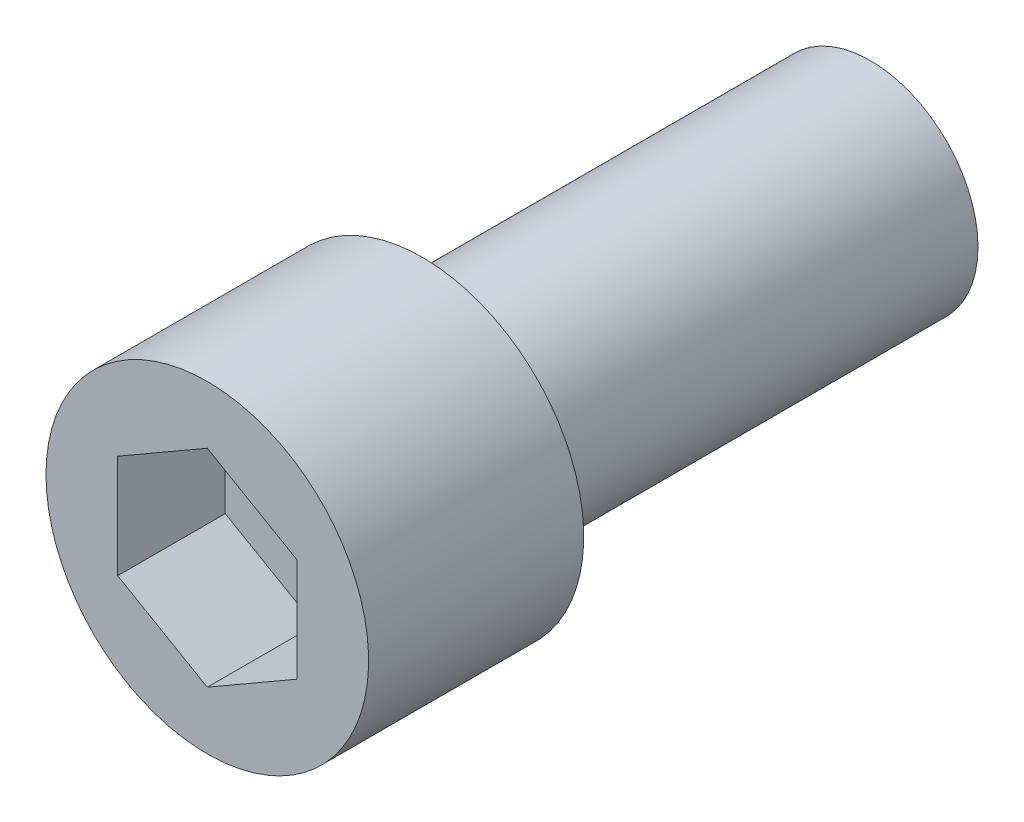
ISO-10303-21;
HEADER;
FILE_DESCRIPTION(('STEP AP214'),'2;1');
FILE_NAME('part.step','',(''),(''),'','','');
FILE_SCHEMA(('AUTOMOTIVE_DESIGN { 1 0 10303 214 1 1 1 1 }'));
ENDSEC;
DATA;
#1=APPLICATION_CONTEXT('core data for automotive mechanical design processes');
#2=APPLICATION_PROTOCOL_DEFINITION('international standard','automotive_design',2000,#1);
#3=PRODUCT_CONTEXT('',#1,'mechanical');
#4=PRODUCT('Part','Part','',(#3));
#5=PRODUCT_RELATED_PRODUCT_CATEGORY('part','',(#4));
#6=PRODUCT_DEFINITION_FORMATION('','',#4);
#7=PRODUCT_DEFINITION_CONTEXT('part definition',#1,'design');
#8=PRODUCT_DEFINITION('design','',#6,#7);
#9=PRODUCT_DEFINITION_SHAPE('','',#8);
#10=(LENGTH_UNIT() NAMED_UNIT(*) SI_UNIT(.MILLI.,.METRE.));
#11=(NAMED_UNIT(*) PLANE_ANGLE_UNIT() SI_UNIT($,.RADIAN.));
#12=(NAMED_UNIT(*) SI_UNIT($,.STERADIAN.) SOLID_ANGLE_UNIT());
#13=UNCERTAINTY_MEASURE_WITH_UNIT(LENGTH_MEASURE(1.E-05),#10,'distance_accuracy_value','');
#14=(GEOMETRIC_REPRESENTATION_CONTEXT(3) GLOBAL_UNCERTAINTY_ASSIGNED_CONTEXT((#13)) GLOBAL_UNIT_ASSIGNED_CONTEXT((#10,
#11,#12)) REPRESENTATION_CONTEXT('',''));
#15=CARTESIAN_POINT('',(0.,0.,0.));
#16=DIRECTION('',(0.,0.,1.));
#17=DIRECTION('',(1.,0.,0.));
#18=AXIS2_PLACEMENT_3D('',#15,#16,#17);
#19=CARTESIAN_POINT('',(0.,0.,12.));
#20=DIRECTION('',(0.,0.,-1.));
#21=DIRECTION('',(-1.,0.,0.));
#22=AXIS2_PLACEMENT_3D('',#19,#20,#21);
#23=PLANE('',#22);
#24=DIRECTION('',(0.866025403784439,0.5,0.));
#25=VECTOR('',#24,1.);
#26=CARTESIAN_POINT('',(0.,-5.77350269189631,12.));
#27=LINE('',#26,#25);
#28=CARTESIAN_POINT('',(0.,-5.77350269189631,12.));
#29=VERTEX_POINT('',#28);
#30=CARTESIAN_POINT('',(5.,-2.88675134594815,12.));
#31=VERTEX_POINT('',#30);
#32=EDGE_CURVE('E83',#29,#31,#27,.T.);
#33=ORIENTED_EDGE('',*,*,#32,.F.);
#34=DIRECTION('',(0.866025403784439,-0.5,0.));
#35=VECTOR('',#34,1.);
#36=CARTESIAN_POINT('',(-5.,-2.88675134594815,12.));
#37=LINE('',#36,#35);
#38=CARTESIAN_POINT('',(-5.,-2.88675134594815,12.));
#39=VERTEX_POINT('',#38);
#40=EDGE_CURVE('E29',#39,#29,#37,.T.);
#41=ORIENTED_EDGE('',*,*,#40,.F.);
#42=DIRECTION('',(0.,-1.,0.));
#43=VECTOR('',#42,1.);
#44=CARTESIAN_POINT('',(-5.,2.88675134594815,12.));
#45=LINE('',#44,#43);
#46=CARTESIAN_POINT('',(-5.,2.88675134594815,12.));
#47=VERTEX_POINT('',#46);
#48=EDGE_CURVE('E98',#47,#39,#45,.T.);
#49=ORIENTED_EDGE('',*,*,#48,.F.);
#50=DIRECTION('',(-0.866025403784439,-0.5,0.));
#51=VECTOR('',#50,1.);
#52=CARTESIAN_POINT('',(0.,5.77350269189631,12.));
#53=LINE('',#52,#51);
#54=CARTESIAN_POINT('',(0.,5.77350269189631,12.));
#55=VERTEX_POINT('',#54);
#56=EDGE_CURVE('E92',#55,#47,#53,.T.);
#57=ORIENTED_EDGE('',*,*,#56,.F.);
#58=DIRECTION('',(-0.866025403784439,0.5,0.));
#59=VECTOR('',#58,1.);
#60=CARTESIAN_POINT('',(5.,2.88675134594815,12.));
#61=LINE('',#60,#59);
#62=CARTESIAN_POINT('',(5.,2.88675134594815,12.));
#63=VERTEX_POINT('',#62);
#64=EDGE_CURVE('E90',#63,#55,#61,.T.);
#65=ORIENTED_EDGE('',*,*,#64,.F.);
#66=DIRECTION('',(0.,1.,0.));
#67=VECTOR('',#66,1.);
#68=CARTESIAN_POINT('',(5.,-2.88675134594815,12.));
#69=LINE('',#68,#67);
#70=EDGE_CURVE('E72',#31,#63,#69,.T.);
#71=ORIENTED_EDGE('',*,*,#70,.F.);
#72=EDGE_LOOP('',(#33,#41,#49,#57,#65,#71));
#73=FACE_BOUND('',#72,.T.);
#74=CARTESIAN_POINT('',(0.,0.,12.));
#75=DIRECTION('',(0.,0.,-1.));
#76=DIRECTION('',(-1.,0.,0.));
#77=AXIS2_PLACEMENT_3D('',#74,#75,#76);
#78=CIRCLE('',#77,9.);
#79=CARTESIAN_POINT('',(-9.,0.,12.));
#80=VERTEX_POINT('',#79);
#81=EDGE_CURVE('E9',#80,#80,#78,.T.);
#82=ORIENTED_EDGE('',*,*,#81,.F.);
#83=EDGE_LOOP('',(#82));
#84=FACE_BOUND('',#83,.T.);
#85=ADVANCED_FACE('F15',(#73,#84),#23,.F.);
#86=CARTESIAN_POINT('',(0.,0.,0.));
#87=DIRECTION('',(0.,0.,-1.));
#88=DIRECTION('',(-1.,0.,0.));
#89=AXIS2_PLACEMENT_3D('',#86,#87,#88);
#90=CYLINDRICAL_SURFACE('',#89,9.);
#91=CARTESIAN_POINT('',(0.,0.,0.));
#92=DIRECTION('',(0.,0.,-1.));
#93=DIRECTION('',(-1.,0.,0.));
#94=AXIS2_PLACEMENT_3D('',#91,#92,#93);
#95=CIRCLE('',#94,9.);
#96=CARTESIAN_POINT('',(-9.,0.,0.));
#97=VERTEX_POINT('',#96);
#98=EDGE_CURVE('E22',#97,#97,#95,.T.);
#99=ORIENTED_EDGE('',*,*,#98,.F.);
#100=EDGE_LOOP('',(#99));
#101=FACE_BOUND('',#100,.T.);
#102=ORIENTED_EDGE('',*,*,#81,.T.);
#103=EDGE_LOOP('',(#102));
#104=FACE_BOUND('',#103,.T.);
#105=ADVANCED_FACE('F132',(#101,#104),#90,.T.);
#106=CARTESIAN_POINT('',(0.,9.,0.));
#107=DIRECTION('',(0.,0.,1.));
#108=DIRECTION('',(1.,0.,0.));
#109=AXIS2_PLACEMENT_3D('',#106,#107,#108);
#110=PLANE('',#109);
#111=CARTESIAN_POINT('',(0.,0.,0.));
#112=DIRECTION('',(0.,0.,-1.));
#113=DIRECTION('',(-1.,0.,0.));
#114=AXIS2_PLACEMENT_3D('',#111,#112,#113);
#115=CIRCLE('',#114,6.);
#116=CARTESIAN_POINT('',(-6.,0.,0.));
#117=VERTEX_POINT('',#116);
#118=EDGE_CURVE('E125',#117,#117,#115,.T.);
#119=ORIENTED_EDGE('',*,*,#118,.F.);
#120=EDGE_LOOP('',(#119));
#121=FACE_BOUND('',#120,.T.);
#122=ORIENTED_EDGE('',*,*,#98,.T.);
#123=EDGE_LOOP('',(#122));
#124=FACE_BOUND('',#123,.T.);
#125=ADVANCED_FACE('F130',(#121,#124),#110,.F.);
#126=CARTESIAN_POINT('',(0.,0.,0.));
#127=DIRECTION('',(0.,0.,-1.));
#128=DIRECTION('',(-1.,0.,0.));
#129=AXIS2_PLACEMENT_3D('',#126,#127,#128);
#130=CYLINDRICAL_SURFACE('',#129,6.);
#131=CARTESIAN_POINT('',(0.,0.,-25.));
#132=DIRECTION('',(0.,0.,-1.));
#133=DIRECTION('',(-1.,0.,0.));
#134=AXIS2_PLACEMENT_3D('',#131,#132,#133);
#135=CIRCLE('',#134,6.);
#136=CARTESIAN_POINT('',(-6.,0.,-25.));
#137=VERTEX_POINT('',#136);
#138=EDGE_CURVE('E116',#137,#137,#135,.T.);
#139=ORIENTED_EDGE('',*,*,#138,.F.);
#140=EDGE_LOOP('',(#139));
#141=FACE_BOUND('',#140,.T.);
#142=ORIENTED_EDGE('',*,*,#118,.T.);
#143=EDGE_LOOP('',(#142));
#144=FACE_BOUND('',#143,.T.);
#145=ADVANCED_FACE('F156',(#141,#144),#130,.T.);
#146=CARTESIAN_POINT('',(0.,6.,-25.));
#147=DIRECTION('',(0.,0.,1.));
#148=DIRECTION('',(1.,0.,0.));
#149=AXIS2_PLACEMENT_3D('',#146,#147,#148);
#150=PLANE('',#149);
#151=ORIENTED_EDGE('',*,*,#138,.T.);
#152=EDGE_LOOP('',(#151));
#153=FACE_BOUND('',#152,.T.);
#154=ADVANCED_FACE('F165',(#153),#150,.F.);
#155=CARTESIAN_POINT('',(-5.,-2.88675134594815,6.));
#156=DIRECTION('',(-0.5,-0.866025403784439,0.));
#157=DIRECTION('',(0.866025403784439,-0.5,0.));
#158=AXIS2_PLACEMENT_3D('',#155,#156,#157);
#159=PLANE('',#158);
#160=ORIENTED_EDGE('',*,*,#40,.T.);
#161=DIRECTION('',(0.,0.,1.));
#162=VECTOR('',#161,1.);
#163=CARTESIAN_POINT('',(0.,-5.77350269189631,6.));
#164=LINE('',#163,#162);
#165=CARTESIAN_POINT('',(0.,-5.77350269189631,6.));
#166=VERTEX_POINT('',#165);
#167=EDGE_CURVE('E80',#166,#29,#164,.T.);
#168=ORIENTED_EDGE('',*,*,#167,.F.);
#169=DIRECTION('',(0.866025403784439,-0.5,0.));
#170=VECTOR('',#169,1.);
#171=CARTESIAN_POINT('',(-5.,-2.88675134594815,6.));
#172=LINE('',#171,#170);
#173=CARTESIAN_POINT('',(-5.,-2.88675134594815,6.));
#174=VERTEX_POINT('',#173);
#175=EDGE_CURVE('E100',#174,#166,#172,.T.);
#176=ORIENTED_EDGE('',*,*,#175,.F.);
#177=DIRECTION('',(0.,0.,1.));
#178=VECTOR('',#177,1.);
#179=CARTESIAN_POINT('',(-5.,-2.88675134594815,6.));
#180=LINE('',#179,#178);
#181=EDGE_CURVE('E36',#174,#39,#180,.T.);
#182=ORIENTED_EDGE('',*,*,#181,.T.);
#183=EDGE_LOOP('',(#160,#168,#176,#182));
#184=FACE_BOUND('',#183,.T.);
#185=ADVANCED_FACE('F174',(#184),#159,.F.);
#186=CARTESIAN_POINT('',(-5.,2.88675134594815,6.));
#187=DIRECTION('',(-1.,0.,0.));
#188=DIRECTION('',(0.,0.,1.));
#189=AXIS2_PLACEMENT_3D('',#186,#187,#188);
#190=PLANE('',#189);
#191=ORIENTED_EDGE('',*,*,#48,.T.);
#192=ORIENTED_EDGE('',*,*,#181,.F.);
#193=DIRECTION('',(0.,-1.,0.));
#194=VECTOR('',#193,1.);
#195=CARTESIAN_POINT('',(-5.,2.88675134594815,6.));
#196=LINE('',#195,#194);
#197=CARTESIAN_POINT('',(-5.,2.88675134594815,6.));
#198=VERTEX_POINT('',#197);
#199=EDGE_CURVE('E112',#198,#174,#196,.T.);
#200=ORIENTED_EDGE('',*,*,#199,.F.);
#201=DIRECTION('',(0.,0.,1.));
#202=VECTOR('',#201,1.);
#203=CARTESIAN_POINT('',(-5.,2.88675134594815,6.));
#204=LINE('',#203,#202);
#205=EDGE_CURVE('E117',#198,#47,#204,.T.);
#206=ORIENTED_EDGE('',*,*,#205,.T.);
#207=EDGE_LOOP('',(#191,#192,#200,#206));
#208=FACE_BOUND('',#207,.T.);
#209=ADVANCED_FACE('F183',(#208),#190,.F.);
#210=CARTESIAN_POINT('',(0.,5.77350269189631,6.));
#211=DIRECTION('',(-0.5,0.866025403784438,0.));
#212=DIRECTION('',(-0.866025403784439,-0.5,0.));
#213=AXIS2_PLACEMENT_3D('',#210,#211,#212);
#214=PLANE('',#213);
#215=ORIENTED_EDGE('',*,*,#56,.T.);
#216=ORIENTED_EDGE('',*,*,#205,.F.);
#217=DIRECTION('',(-0.866025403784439,-0.5,0.));
#218=VECTOR('',#217,1.);
#219=CARTESIAN_POINT('',(0.,5.77350269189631,6.));
#220=LINE('',#219,#218);
#221=CARTESIAN_POINT('',(0.,5.77350269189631,6.));
#222=VERTEX_POINT('',#221);
#223=EDGE_CURVE('E109',#222,#198,#220,.T.);
#224=ORIENTED_EDGE('',*,*,#223,.F.);
#225=DIRECTION('',(0.,0.,1.));
#226=VECTOR('',#225,1.);
#227=CARTESIAN_POINT('',(0.,5.77350269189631,6.));
#228=LINE('',#227,#226);
#229=EDGE_CURVE('E119',#222,#55,#228,.T.);
#230=ORIENTED_EDGE('',*,*,#229,.T.);
#231=EDGE_LOOP('',(#215,#216,#224,#230));
#232=FACE_BOUND('',#231,.T.);
#233=ADVANCED_FACE('F191',(#232),#214,.F.);
#234=CARTESIAN_POINT('',(5.,2.88675134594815,6.));
#235=DIRECTION('',(0.5,0.866025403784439,0.));
#236=DIRECTION('',(-0.866025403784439,0.5,0.));
#237=AXIS2_PLACEMENT_3D('',#234,#235,#236);
#238=PLANE('',#237);
#239=ORIENTED_EDGE('',*,*,#64,.T.);
#240=ORIENTED_EDGE('',*,*,#229,.F.);
#241=DIRECTION('',(-0.866025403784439,0.5,0.));
#242=VECTOR('',#241,1.);
#243=CARTESIAN_POINT('',(5.,2.88675134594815,6.));
#244=LINE('',#243,#242);
#245=CARTESIAN_POINT('',(5.,2.88675134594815,6.));
#246=VERTEX_POINT('',#245);
#247=EDGE_CURVE('E106',#246,#222,#244,.T.);
#248=ORIENTED_EDGE('',*,*,#247,.F.);
#249=DIRECTION('',(0.,0.,1.));
#250=VECTOR('',#249,1.);
#251=CARTESIAN_POINT('',(5.,2.88675134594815,6.));
#252=LINE('',#251,#250);
#253=EDGE_CURVE('E79',#246,#63,#252,.T.);
#254=ORIENTED_EDGE('',*,*,#253,.T.);
#255=EDGE_LOOP('',(#239,#240,#248,#254));
#256=FACE_BOUND('',#255,.T.);
#257=ADVANCED_FACE('F199',(#256),#238,.F.);
#258=CARTESIAN_POINT('',(5.,-2.88675134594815,6.));
#259=DIRECTION('',(1.,0.,0.));
#260=DIRECTION('',(0.,0.,-1.));
#261=AXIS2_PLACEMENT_3D('',#258,#259,#260);
#262=PLANE('',#261);
#263=ORIENTED_EDGE('',*,*,#70,.T.);
#264=ORIENTED_EDGE('',*,*,#253,.F.);
#265=DIRECTION('',(0.,1.,0.));
#266=VECTOR('',#265,1.);
#267=CARTESIAN_POINT('',(5.,-2.88675134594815,6.));
#268=LINE('',#267,#266);
#269=CARTESIAN_POINT('',(5.,-2.88675134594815,6.));
#270=VERTEX_POINT('',#269);
#271=EDGE_CURVE('E75',#270,#246,#268,.T.);
#272=ORIENTED_EDGE('',*,*,#271,.F.);
#273=DIRECTION('',(0.,0.,1.));
#274=VECTOR('',#273,1.);
#275=CARTESIAN_POINT('',(5.,-2.88675134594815,6.));
#276=LINE('',#275,#274);
#277=EDGE_CURVE('E68',#270,#31,#276,.T.);
#278=ORIENTED_EDGE('',*,*,#277,.T.);
#279=EDGE_LOOP('',(#263,#264,#272,#278));
#280=FACE_BOUND('',#279,.T.);
#281=ADVANCED_FACE('F70',(#280),#262,.F.);
#282=CARTESIAN_POINT('',(0.,-5.77350269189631,6.));
#283=DIRECTION('',(0.5,-0.866025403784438,0.));
#284=DIRECTION('',(0.866025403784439,0.5,0.));
#285=AXIS2_PLACEMENT_3D('',#282,#283,#284);
#286=PLANE('',#285);
#287=ORIENTED_EDGE('',*,*,#32,.T.);
#288=ORIENTED_EDGE('',*,*,#277,.F.);
#289=DIRECTION('',(0.866025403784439,0.5,0.));
#290=VECTOR('',#289,1.);
#291=CARTESIAN_POINT('',(0.,-5.77350269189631,6.));
#292=LINE('',#291,#290);
#293=EDGE_CURVE('E103',#166,#270,#292,.T.);
#294=ORIENTED_EDGE('',*,*,#293,.F.);
#295=ORIENTED_EDGE('',*,*,#167,.T.);
#296=EDGE_LOOP('',(#287,#288,#294,#295));
#297=FACE_BOUND('',#296,.T.);
#298=ADVANCED_FACE('F84',(#297),#286,.F.);
#299=CARTESIAN_POINT('',(-10.,0.,6.));
#300=DIRECTION('',(0.,0.,-1.));
#301=DIRECTION('',(-1.,0.,0.));
#302=AXIS2_PLACEMENT_3D('',#299,#300,#301);
#303=PLANE('',#302);
#304=ORIENTED_EDGE('',*,*,#175,.T.);
#305=ORIENTED_EDGE('',*,*,#293,.T.);
#306=ORIENTED_EDGE('',*,*,#271,.T.);
#307=ORIENTED_EDGE('',*,*,#247,.T.);
#308=ORIENTED_EDGE('',*,*,#223,.T.);
#309=ORIENTED_EDGE('',*,*,#199,.T.);
#310=EDGE_LOOP('',(#304,#305,#306,#307,#308,#309));
#311=FACE_BOUND('',#310,.T.);
#312=ADVANCED_FACE('F223',(#311),#303,.F.);
#313=CLOSED_SHELL('',(#85,#105,#125,#145,#154,#185,#209,#233,#257,#281,#298,#312));
#314=MANIFOLD_SOLID_BREP('B1',#313);
#315=ADVANCED_BREP_SHAPE_REPRESENTATION('',(#18,#314),#14);
#316=SHAPE_DEFINITION_REPRESENTATION(#9,#315);
ENDSEC;
END-ISO-10303-21;
